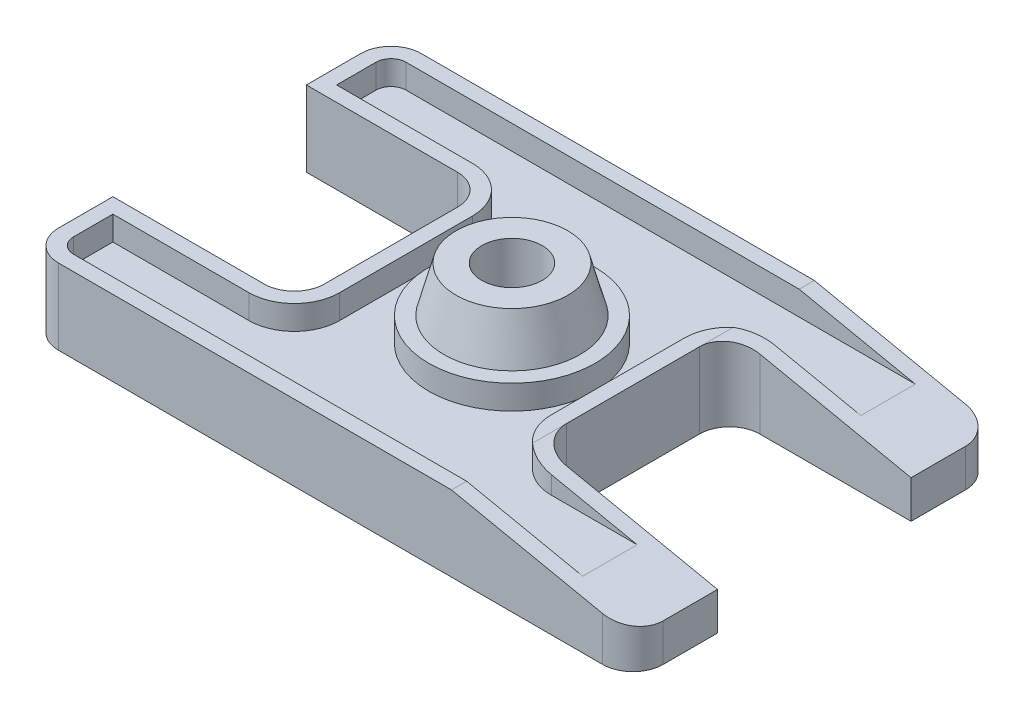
from build123d import *

# Parameters (mm, degrees)
BOSS_EXTRUDE1_DEPTH     = 25
BOSS_EXTRUDE2_START     = 25
SKETCH1_3_R             = 22.5
BOSS_EXTRUDE2_DEPTH     = 15
BOSS_EXTRUDE2_TAPER     = 15
SKETCH4_R               = 27.5
CUT_EXTRUDE3_DEPTH      = 8
SKETCH1_4_R             = 10
CUT_EXTRUDE1_DEPTH      = 124.288280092
CUT_EXTRUDE2_DEPTH      = 124.288280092
CUT_EXTRUDE2_DEPTH_BACK = 124.288280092


with BuildPart() as part:
    # Sketch1 → Boss-Extrude1 (new body)
    with BuildSketch(Plane(origin=(0, 0, 0), x_dir=(1, 0, 0), z_dir=(0, 1, 0))):
        with BuildLine():
            Line((-90, -60), (90, -60))
            ThreePointArc((90, -60), (97.071067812, -57.071067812), (100, -50))
            Line((100, -50), (100, -32))
            Line((100, -32), (50, -32))
            ThreePointArc((50, -32), (42.928932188, -29.071067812), (40, -22))
            Line((40, -22), (40, 22))
            ThreePointArc((40, 22), (42.928932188, 29.071067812), (50, 32))
            Line((50, 32), (100, 32))
            Line((100, 32), (100, 50))
            ThreePointArc((100, 50), (97.071067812, 57.071067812), (90, 60))
            Line((90, 60), (-90, 60))
            ThreePointArc((-90, 60), (-97.071067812, 57.071067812), (-100, 50))
            Line((-100, 50), (-100, 32))
            Line((-100, 32), (-50, 32))
            ThreePointArc((-50, 32), (-42.928932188, 29.071067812), (-40, 22))
            Line((-40, 22), (-40, -22))
            ThreePointArc((-40, -22), (-42.928932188, -29.071067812), (-50, -32))
            Line((-50, -32), (-100, -32))
            Line((-100, -32), (-100, -50))
            ThreePointArc((-100, -50), (-97.071067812, -57.071067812), (-90, -60))
        make_face()
    extrude(amount=BOSS_EXTRUDE1_DEPTH)

    # Sketch1_3 → Boss-Extrude2 (add)
    with BuildSketch(Plane(origin=(0, 0, 0), x_dir=(1, 0, 0), z_dir=(0, 1, 0)).offset(BOSS_EXTRUDE2_START)):
        Circle(SKETCH1_3_R)
    extrude(amount=BOSS_EXTRUDE2_DEPTH, taper=BOSS_EXTRUDE2_TAPER)

    # Sketch4 → Cut-Extrude3 (cut)
    with BuildSketch(Plane(origin=(0, 25, 0), x_dir=(1, 0, 0), z_dir=(0, 1, 0))):
        with BuildLine():
            Line((-95, 50), (-95, 37))
            Line((-95, 37), (-50, 37))
            ThreePointArc((-50, 37), (-39.393398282, 32.606601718), (-35, 22))
            Line((-35, 22), (-35, -22))
            ThreePointArc((-35, -22), (-39.393398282, -32.606601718), (-50, -37))
            Line((-50, -37), (-95, -37))
            Line((-95, -37), (-95, -50))
            ThreePointArc((-95, -50), (-93.535533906, -53.535533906), (-90, -55))
            Line((-90, -55), (90, -55))
            ThreePointArc((90, -55), (93.535533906, -53.535533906), (95, -50))
            Line((95, -50), (95, -37))
            Line((95, -37), (50, -37))
            ThreePointArc((50, -37), (39.393398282, -32.606601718), (35, -22))
            Line((35, -22), (35, 22))
            ThreePointArc((35, 22), (39.393398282, 32.606601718), (50, 37))
            Line((50, 37), (95, 37))
            Line((95, 37), (95, 50))
            ThreePointArc((95, 50), (93.535533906, 53.535533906), (90, 55))
            Line((90, 55), (-90, 55))
            ThreePointArc((-90, 55), (-93.535533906, 53.535533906), (-95, 50))
        make_face()
        with Locations(Location((0, 0, 0), (0, 0, 270))):
            Circle(SKETCH4_R, mode=Mode.SUBTRACT)
    extrude(amount=-CUT_EXTRUDE3_DEPTH, mode=Mode.SUBTRACT)

    # Sketch1_4 → Cut-Extrude1 (cut, through all)
    with BuildSketch(Plane(origin=(0, 0, 0), x_dir=(1, 0, 0), z_dir=(0, 1, 0))):
        with Locations(Location((0, 0, 0), (0, 0, 270))):
            Circle(SKETCH1_4_R)
    extrude(amount=CUT_EXTRUDE1_DEPTH, mode=Mode.SUBTRACT)

    # Sketch3 → Cut-Extrude2 (cut, two sides: drawn at the far end of the back side and taken through both)
    with BuildSketch(Plane.XY.offset(-CUT_EXTRUDE2_DEPTH_BACK)):
        Polygon((40, 25), (100, 12.5), (100, 25), align=None)
    extrude(amount=CUT_EXTRUDE2_DEPTH + CUT_EXTRUDE2_DEPTH_BACK, mode=Mode.SUBTRACT)


solid = part.part
